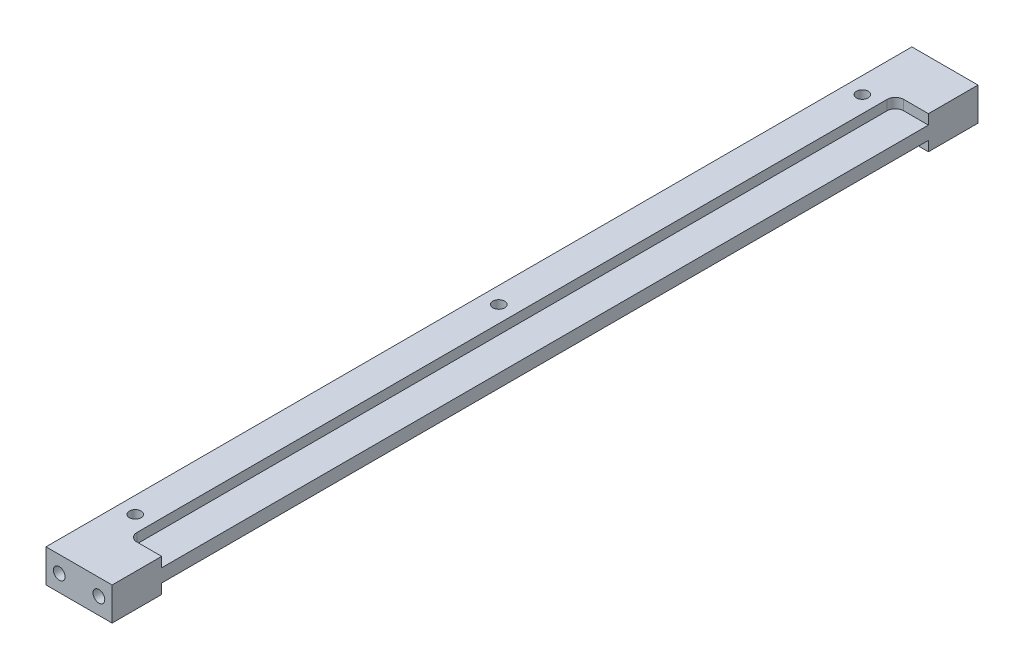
ISO-10303-21;
HEADER;
FILE_DESCRIPTION(('STEP AP214'),'2;1');
FILE_NAME('part.step','',(''),(''),'','','');
FILE_SCHEMA(('AUTOMOTIVE_DESIGN { 1 0 10303 214 1 1 1 1 }'));
ENDSEC;
DATA;
#1=APPLICATION_CONTEXT('core data for automotive mechanical design processes');
#2=APPLICATION_PROTOCOL_DEFINITION('international standard','automotive_design',2000,#1);
#3=PRODUCT_CONTEXT('',#1,'mechanical');
#4=PRODUCT('Part','Part','',(#3));
#5=PRODUCT_RELATED_PRODUCT_CATEGORY('part','',(#4));
#6=PRODUCT_DEFINITION_FORMATION('','',#4);
#7=PRODUCT_DEFINITION_CONTEXT('part definition',#1,'design');
#8=PRODUCT_DEFINITION('design','',#6,#7);
#9=PRODUCT_DEFINITION_SHAPE('','',#8);
#10=(LENGTH_UNIT() NAMED_UNIT(*) SI_UNIT(.MILLI.,.METRE.));
#11=(NAMED_UNIT(*) PLANE_ANGLE_UNIT() SI_UNIT($,.RADIAN.));
#12=(NAMED_UNIT(*) SI_UNIT($,.STERADIAN.) SOLID_ANGLE_UNIT());
#13=UNCERTAINTY_MEASURE_WITH_UNIT(LENGTH_MEASURE(1.E-05),#10,'distance_accuracy_value','');
#14=(GEOMETRIC_REPRESENTATION_CONTEXT(3) GLOBAL_UNCERTAINTY_ASSIGNED_CONTEXT((#13)) GLOBAL_UNIT_ASSIGNED_CONTEXT((#10,
#11,#12)) REPRESENTATION_CONTEXT('',''));
#15=CARTESIAN_POINT('',(0.,0.,0.));
#16=DIRECTION('',(0.,0.,1.));
#17=DIRECTION('',(1.,0.,0.));
#18=AXIS2_PLACEMENT_3D('',#15,#16,#17);
#19=CARTESIAN_POINT('',(-66.675,-63.5000000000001,166.37));
#20=DIRECTION('',(1.,0.,0.));
#21=DIRECTION('',(0.,0.,-0.999999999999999));
#22=AXIS2_PLACEMENT_3D('',#19,#20,#21);
#23=PLANE('',#22);
#24=DIRECTION('',(0.,-1.,0.));
#25=VECTOR('',#24,1.);
#26=CARTESIAN_POINT('',(-66.675,-63.5000000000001,0.));
#27=LINE('',#26,#25);
#28=CARTESIAN_POINT('',(-66.6750000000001,-57.1500000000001,0.));
#29=VERTEX_POINT('',#28);
#30=CARTESIAN_POINT('',(-66.675,-63.5000000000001,0.));
#31=VERTEX_POINT('',#30);
#32=EDGE_CURVE('E271',#29,#31,#27,.T.);
#33=ORIENTED_EDGE('',*,*,#32,.T.);
#34=DIRECTION('',(0.,0.,-0.999999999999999));
#35=VECTOR('',#34,1.);
#36=CARTESIAN_POINT('',(-66.675,-63.5000000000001,166.37));
#37=LINE('',#36,#35);
#38=CARTESIAN_POINT('',(-66.675,-63.5000000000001,166.37));
#39=VERTEX_POINT('',#38);
#40=EDGE_CURVE('E11',#39,#31,#37,.T.);
#41=ORIENTED_EDGE('',*,*,#40,.F.);
#42=DIRECTION('',(0.,-1.,0.));
#43=VECTOR('',#42,1.);
#44=CARTESIAN_POINT('',(-66.675,-63.5000000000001,166.37));
#45=LINE('',#44,#43);
#46=CARTESIAN_POINT('',(-66.6750000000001,-57.1500000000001,166.37));
#47=VERTEX_POINT('',#46);
#48=EDGE_CURVE('E282',#47,#39,#45,.T.);
#49=ORIENTED_EDGE('',*,*,#48,.F.);
#50=DIRECTION('',(0.,0.,-0.999999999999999));
#51=VECTOR('',#50,1.);
#52=CARTESIAN_POINT('',(-66.6750000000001,-57.1500000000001,166.37));
#53=LINE('',#52,#51);
#54=EDGE_CURVE('E176',#47,#29,#53,.T.);
#55=ORIENTED_EDGE('',*,*,#54,.T.);
#56=EDGE_LOOP('',(#33,#41,#49,#55));
#57=FACE_BOUND('',#56,.T.);
#58=ADVANCED_FACE('F33',(#57),#23,.F.);
#59=CARTESIAN_POINT('',(-66.675,-63.5000000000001,166.37));
#60=DIRECTION('',(0.,1.,0.));
#61=DIRECTION('',(0.,0.,0.999999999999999));
#62=AXIS2_PLACEMENT_3D('',#59,#60,#61);
#63=PLANE('',#62);
#64=CARTESIAN_POINT('',(-63.5000000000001,-63.5,152.4));
#65=DIRECTION('',(0.,1.,0.));
#66=DIRECTION('',(0.,0.,0.999999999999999));
#67=AXIS2_PLACEMENT_3D('',#64,#65,#66);
#68=CIRCLE('',#67,1.1303);
#69=CARTESIAN_POINT('',(-63.5000000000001,-63.5,153.5303));
#70=VERTEX_POINT('',#69);
#71=EDGE_CURVE('E256',#70,#70,#68,.T.);
#72=ORIENTED_EDGE('',*,*,#71,.T.);
#73=EDGE_LOOP('',(#72));
#74=FACE_BOUND('',#73,.T.);
#75=CARTESIAN_POINT('',(-63.5000000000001,-63.5,82.55));
#76=DIRECTION('',(0.,1.,0.));
#77=DIRECTION('',(0.,0.,0.999999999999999));
#78=AXIS2_PLACEMENT_3D('',#75,#76,#77);
#79=CIRCLE('',#78,1.1303);
#80=CARTESIAN_POINT('',(-63.5000000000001,-63.5,83.6803));
#81=VERTEX_POINT('',#80);
#82=EDGE_CURVE('E262',#81,#81,#79,.T.);
#83=ORIENTED_EDGE('',*,*,#82,.T.);
#84=EDGE_LOOP('',(#83));
#85=FACE_BOUND('',#84,.T.);
#86=CARTESIAN_POINT('',(-63.5000000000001,-63.5,12.7));
#87=DIRECTION('',(0.,1.,0.));
#88=DIRECTION('',(0.,0.,0.999999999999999));
#89=AXIS2_PLACEMENT_3D('',#86,#87,#88);
#90=CIRCLE('',#89,1.1303);
#91=CARTESIAN_POINT('',(-63.5000000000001,-63.5,13.8303));
#92=VERTEX_POINT('',#91);
#93=EDGE_CURVE('E268',#92,#92,#90,.T.);
#94=ORIENTED_EDGE('',*,*,#93,.T.);
#95=EDGE_LOOP('',(#94));
#96=FACE_BOUND('',#95,.T.);
#97=CARTESIAN_POINT('',(-58.7375000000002,-63.5000000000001,155.2575));
#98=DIRECTION('',(0.,-1.,0.));
#99=DIRECTION('',(0.,0.,0.999999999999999));
#100=AXIS2_PLACEMENT_3D('',#97,#98,#99);
#101=CIRCLE('',#100,1.58750000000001);
#102=CARTESIAN_POINT('',(-58.7375000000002,-63.5000000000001,156.845));
#103=VERTEX_POINT('',#102);
#104=CARTESIAN_POINT('',(-60.3250000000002,-63.5000000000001,155.2575));
#105=VERTEX_POINT('',#104);
#106=EDGE_CURVE('E195',#103,#105,#101,.T.);
#107=ORIENTED_EDGE('',*,*,#106,.F.);
#108=DIRECTION('',(-1.,0.,0.));
#109=VECTOR('',#108,1.);
#110=CARTESIAN_POINT('',(-53.9750000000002,-63.5000000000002,156.845));
#111=LINE('',#110,#109);
#112=CARTESIAN_POINT('',(-53.9750000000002,-63.5000000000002,156.845));
#113=VERTEX_POINT('',#112);
#114=EDGE_CURVE('E192',#113,#103,#111,.T.);
#115=ORIENTED_EDGE('',*,*,#114,.F.);
#116=DIRECTION('',(0.,0.,-0.999999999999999));
#117=VECTOR('',#116,1.);
#118=CARTESIAN_POINT('',(-53.9750000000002,-63.5000000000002,166.37));
#119=LINE('',#118,#117);
#120=CARTESIAN_POINT('',(-53.9750000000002,-63.5000000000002,166.37));
#121=VERTEX_POINT('',#120);
#122=EDGE_CURVE('E40',#121,#113,#119,.T.);
#123=ORIENTED_EDGE('',*,*,#122,.F.);
#124=DIRECTION('',(1.,0.,0.));
#125=VECTOR('',#124,1.);
#126=CARTESIAN_POINT('',(-66.675,-63.5000000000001,166.37));
#127=LINE('',#126,#125);
#128=EDGE_CURVE('E189',#39,#121,#127,.T.);
#129=ORIENTED_EDGE('',*,*,#128,.F.);
#130=ORIENTED_EDGE('',*,*,#40,.T.);
#131=DIRECTION('',(1.,0.,0.));
#132=VECTOR('',#131,1.);
#133=CARTESIAN_POINT('',(-66.675,-63.5000000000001,0.));
#134=LINE('',#133,#132);
#135=CARTESIAN_POINT('',(-53.9750000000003,-63.5000000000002,1.66533453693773E-13));
#136=VERTEX_POINT('',#135);
#137=EDGE_CURVE('E274',#31,#136,#134,.T.);
#138=ORIENTED_EDGE('',*,*,#137,.T.);
#139=CARTESIAN_POINT('',(-53.9750000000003,-63.5000000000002,9.52500000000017));
#140=VERTEX_POINT('',#139);
#141=EDGE_CURVE('E173',#140,#136,#119,.T.);
#142=ORIENTED_EDGE('',*,*,#141,.F.);
#143=DIRECTION('',(1.,0.,0.));
#144=VECTOR('',#143,1.);
#145=CARTESIAN_POINT('',(-53.9750000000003,-63.5000000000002,9.52500000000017));
#146=LINE('',#145,#144);
#147=CARTESIAN_POINT('',(-58.7375000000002,-63.5000000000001,9.52499999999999));
#148=VERTEX_POINT('',#147);
#149=EDGE_CURVE('E198',#148,#140,#146,.T.);
#150=ORIENTED_EDGE('',*,*,#149,.F.);
#151=CARTESIAN_POINT('',(-58.7375000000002,-63.5000000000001,11.1125));
#152=DIRECTION('',(0.,-1.,0.));
#153=DIRECTION('',(0.,0.,0.999999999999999));
#154=AXIS2_PLACEMENT_3D('',#151,#152,#153);
#155=CIRCLE('',#154,1.5875);
#156=CARTESIAN_POINT('',(-60.3250000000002,-63.5000000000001,11.1125));
#157=VERTEX_POINT('',#156);
#158=EDGE_CURVE('E203',#157,#148,#155,.T.);
#159=ORIENTED_EDGE('',*,*,#158,.F.);
#160=DIRECTION('',(0.,0.,-0.999999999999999));
#161=VECTOR('',#160,1.);
#162=CARTESIAN_POINT('',(-60.3250000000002,-63.5000000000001,11.1125));
#163=LINE('',#162,#161);
#164=EDGE_CURVE('E306',#105,#157,#163,.T.);
#165=ORIENTED_EDGE('',*,*,#164,.F.);
#166=EDGE_LOOP('',(#107,#115,#123,#129,#130,#138,#142,#150,#159,#165));
#167=FACE_BOUND('',#166,.T.);
#168=ADVANCED_FACE('F188',(#74,#85,#96,#167),#63,.F.);
#169=CARTESIAN_POINT('',(-53.9750000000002,-63.5000000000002,166.37));
#170=DIRECTION('',(-1.,0.,0.));
#171=DIRECTION('',(0.,0.,0.999999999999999));
#172=AXIS2_PLACEMENT_3D('',#169,#170,#171);
#173=PLANE('',#172);
#174=DIRECTION('',(0.,0.,-0.999999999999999));
#175=VECTOR('',#174,1.);
#176=CARTESIAN_POINT('',(-53.9750000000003,-59.0550000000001,156.845));
#177=LINE('',#176,#175);
#178=CARTESIAN_POINT('',(-53.9750000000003,-59.0550000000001,156.845));
#179=VERTEX_POINT('',#178);
#180=CARTESIAN_POINT('',(-53.9750000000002,-59.0550000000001,9.52500000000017));
#181=VERTEX_POINT('',#180);
#182=EDGE_CURVE('E167',#179,#181,#177,.T.);
#183=ORIENTED_EDGE('',*,*,#182,.F.);
#184=DIRECTION('',(0.,1.,0.));
#185=VECTOR('',#184,1.);
#186=CARTESIAN_POINT('',(-53.9750000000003,-59.0550000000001,156.845));
#187=LINE('',#186,#185);
#188=CARTESIAN_POINT('',(-53.9750000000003,-57.1500000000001,156.845));
#189=VERTEX_POINT('',#188);
#190=EDGE_CURVE('E150',#179,#189,#187,.T.);
#191=ORIENTED_EDGE('',*,*,#190,.T.);
#192=DIRECTION('',(0.,0.,-0.999999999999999));
#193=VECTOR('',#192,1.);
#194=CARTESIAN_POINT('',(-53.9750000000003,-57.1500000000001,166.37));
#195=LINE('',#194,#193);
#196=CARTESIAN_POINT('',(-53.9750000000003,-57.1500000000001,166.37));
#197=VERTEX_POINT('',#196);
#198=EDGE_CURVE('E164',#197,#189,#195,.T.);
#199=ORIENTED_EDGE('',*,*,#198,.F.);
#200=DIRECTION('',(0.,1.,0.));
#201=VECTOR('',#200,1.);
#202=CARTESIAN_POINT('',(-53.9750000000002,-63.5000000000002,166.37));
#203=LINE('',#202,#201);
#204=EDGE_CURVE('E184',#121,#197,#203,.T.);
#205=ORIENTED_EDGE('',*,*,#204,.F.);
#206=ORIENTED_EDGE('',*,*,#122,.T.);
#207=DIRECTION('',(0.,-1.,0.));
#208=VECTOR('',#207,1.);
#209=CARTESIAN_POINT('',(-53.9750000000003,-61.5950000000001,156.845));
#210=LINE('',#209,#208);
#211=CARTESIAN_POINT('',(-53.9750000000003,-61.5950000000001,156.845));
#212=VERTEX_POINT('',#211);
#213=EDGE_CURVE('E183',#212,#113,#210,.T.);
#214=ORIENTED_EDGE('',*,*,#213,.F.);
#215=DIRECTION('',(0.,0.,0.999999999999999));
#216=VECTOR('',#215,1.);
#217=CARTESIAN_POINT('',(-53.9750000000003,-61.5950000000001,156.845));
#218=LINE('',#217,#216);
#219=CARTESIAN_POINT('',(-53.9750000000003,-61.5950000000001,9.52500000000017));
#220=VERTEX_POINT('',#219);
#221=EDGE_CURVE('E212',#220,#212,#218,.T.);
#222=ORIENTED_EDGE('',*,*,#221,.F.);
#223=DIRECTION('',(0.,-1.,0.));
#224=VECTOR('',#223,1.);
#225=CARTESIAN_POINT('',(-53.9750000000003,-61.5950000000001,9.52500000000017));
#226=LINE('',#225,#224);
#227=EDGE_CURVE('E222',#220,#140,#226,.T.);
#228=ORIENTED_EDGE('',*,*,#227,.T.);
#229=ORIENTED_EDGE('',*,*,#141,.T.);
#230=DIRECTION('',(0.,1.,0.));
#231=VECTOR('',#230,1.);
#232=CARTESIAN_POINT('',(-53.9750000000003,-63.5000000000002,1.66533453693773E-13));
#233=LINE('',#232,#231);
#234=CARTESIAN_POINT('',(-53.9750000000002,-57.1500000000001,1.66533453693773E-13));
#235=VERTEX_POINT('',#234);
#236=EDGE_CURVE('E277',#136,#235,#233,.T.);
#237=ORIENTED_EDGE('',*,*,#236,.T.);
#238=CARTESIAN_POINT('',(-53.9750000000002,-57.1500000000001,9.52500000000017));
#239=VERTEX_POINT('',#238);
#240=EDGE_CURVE('E174',#239,#235,#195,.T.);
#241=ORIENTED_EDGE('',*,*,#240,.F.);
#242=DIRECTION('',(0.,1.,0.));
#243=VECTOR('',#242,1.);
#244=CARTESIAN_POINT('',(-53.9750000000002,-59.0550000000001,9.52500000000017));
#245=LINE('',#244,#243);
#246=EDGE_CURVE('E47',#181,#239,#245,.T.);
#247=ORIENTED_EDGE('',*,*,#246,.F.);
#248=EDGE_LOOP('',(#183,#191,#199,#205,#206,#214,#222,#228,#229,#237,#241,#247));
#249=FACE_BOUND('',#248,.T.);
#250=ADVANCED_FACE('F162',(#249),#173,.F.);
#251=CARTESIAN_POINT('',(-66.6750000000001,-57.1500000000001,166.37));
#252=DIRECTION('',(0.,-1.,0.));
#253=DIRECTION('',(0.,0.,-0.999999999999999));
#254=AXIS2_PLACEMENT_3D('',#251,#252,#253);
#255=PLANE('',#254);
#256=CARTESIAN_POINT('',(-63.5000000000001,-57.15,152.4));
#257=DIRECTION('',(0.,1.,0.));
#258=DIRECTION('',(0.,0.,0.999999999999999));
#259=AXIS2_PLACEMENT_3D('',#256,#257,#258);
#260=CIRCLE('',#259,1.1303);
#261=CARTESIAN_POINT('',(-63.5000000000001,-57.15,153.5303));
#262=VERTEX_POINT('',#261);
#263=EDGE_CURVE('E253',#262,#262,#260,.T.);
#264=ORIENTED_EDGE('',*,*,#263,.F.);
#265=EDGE_LOOP('',(#264));
#266=FACE_BOUND('',#265,.T.);
#267=CARTESIAN_POINT('',(-63.5000000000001,-57.15,82.55));
#268=DIRECTION('',(0.,1.,0.));
#269=DIRECTION('',(0.,0.,0.999999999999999));
#270=AXIS2_PLACEMENT_3D('',#267,#268,#269);
#271=CIRCLE('',#270,1.1303);
#272=CARTESIAN_POINT('',(-63.5000000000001,-57.15,83.6803));
#273=VERTEX_POINT('',#272);
#274=EDGE_CURVE('E259',#273,#273,#271,.T.);
#275=ORIENTED_EDGE('',*,*,#274,.F.);
#276=EDGE_LOOP('',(#275));
#277=FACE_BOUND('',#276,.T.);
#278=CARTESIAN_POINT('',(-63.5000000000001,-57.15,12.7));
#279=DIRECTION('',(0.,1.,0.));
#280=DIRECTION('',(0.,0.,0.999999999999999));
#281=AXIS2_PLACEMENT_3D('',#278,#279,#280);
#282=CIRCLE('',#281,1.1303);
#283=CARTESIAN_POINT('',(-63.5000000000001,-57.15,13.8303));
#284=VERTEX_POINT('',#283);
#285=EDGE_CURVE('E265',#284,#284,#282,.T.);
#286=ORIENTED_EDGE('',*,*,#285,.F.);
#287=EDGE_LOOP('',(#286));
#288=FACE_BOUND('',#287,.T.);
#289=ORIENTED_EDGE('',*,*,#198,.T.);
#290=DIRECTION('',(1.,0.,0.));
#291=VECTOR('',#290,1.);
#292=CARTESIAN_POINT('',(-53.9750000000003,-57.1500000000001,156.845));
#293=LINE('',#292,#291);
#294=CARTESIAN_POINT('',(-58.7375000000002,-57.1500000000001,156.845));
#295=VERTEX_POINT('',#294);
#296=EDGE_CURVE('E146',#295,#189,#293,.T.);
#297=ORIENTED_EDGE('',*,*,#296,.F.);
#298=CARTESIAN_POINT('',(-58.7375000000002,-57.1500000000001,155.2575));
#299=DIRECTION('',(0.,1.,0.));
#300=DIRECTION('',(0.,0.,0.999999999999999));
#301=AXIS2_PLACEMENT_3D('',#298,#299,#300);
#302=CIRCLE('',#301,1.58750000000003);
#303=CARTESIAN_POINT('',(-60.3250000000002,-57.1500000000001,155.2575));
#304=VERTEX_POINT('',#303);
#305=EDGE_CURVE('E332',#304,#295,#302,.T.);
#306=ORIENTED_EDGE('',*,*,#305,.F.);
#307=DIRECTION('',(0.,0.,0.999999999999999));
#308=VECTOR('',#307,1.);
#309=CARTESIAN_POINT('',(-60.3250000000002,-57.1500000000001,155.2575));
#310=LINE('',#309,#308);
#311=CARTESIAN_POINT('',(-60.3250000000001,-57.1500000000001,11.1125));
#312=VERTEX_POINT('',#311);
#313=EDGE_CURVE('E334',#312,#304,#310,.T.);
#314=ORIENTED_EDGE('',*,*,#313,.F.);
#315=CARTESIAN_POINT('',(-58.7375000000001,-57.1500000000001,11.1125));
#316=DIRECTION('',(0.,1.,0.));
#317=DIRECTION('',(0.,0.,0.999999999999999));
#318=AXIS2_PLACEMENT_3D('',#315,#316,#317);
#319=CIRCLE('',#318,1.5875);
#320=CARTESIAN_POINT('',(-58.7375000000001,-57.1500000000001,9.52500000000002));
#321=VERTEX_POINT('',#320);
#322=EDGE_CURVE('E337',#321,#312,#319,.T.);
#323=ORIENTED_EDGE('',*,*,#322,.F.);
#324=DIRECTION('',(-1.,0.,0.));
#325=VECTOR('',#324,1.);
#326=CARTESIAN_POINT('',(-58.7375000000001,-57.1500000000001,9.52500000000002));
#327=LINE('',#326,#325);
#328=EDGE_CURVE('E157',#239,#321,#327,.T.);
#329=ORIENTED_EDGE('',*,*,#328,.F.);
#330=ORIENTED_EDGE('',*,*,#240,.T.);
#331=DIRECTION('',(-1.,0.,0.));
#332=VECTOR('',#331,1.);
#333=CARTESIAN_POINT('',(-66.6750000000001,-57.1500000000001,0.));
#334=LINE('',#333,#332);
#335=EDGE_CURVE('E280',#235,#29,#334,.T.);
#336=ORIENTED_EDGE('',*,*,#335,.T.);
#337=ORIENTED_EDGE('',*,*,#54,.F.);
#338=DIRECTION('',(-1.,0.,0.));
#339=VECTOR('',#338,1.);
#340=CARTESIAN_POINT('',(-66.6750000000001,-57.1500000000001,166.37));
#341=LINE('',#340,#339);
#342=EDGE_CURVE('E172',#197,#47,#341,.T.);
#343=ORIENTED_EDGE('',*,*,#342,.F.);
#344=EDGE_LOOP('',(#289,#297,#306,#314,#323,#329,#330,#336,#337,#343));
#345=FACE_BOUND('',#344,.T.);
#346=ADVANCED_FACE('F170',(#266,#277,#288,#345),#255,.F.);
#347=CARTESIAN_POINT('',(-66.6750000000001,-57.1500000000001,166.37));
#348=DIRECTION('',(0.,0.,-0.999999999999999));
#349=DIRECTION('',(-1.,0.,0.));
#350=AXIS2_PLACEMENT_3D('',#347,#348,#349);
#351=PLANE('',#350);
#352=CARTESIAN_POINT('',(-56.5150000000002,-60.3033219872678,166.37));
#353=DIRECTION('',(0.,0.,0.999999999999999));
#354=DIRECTION('',(1.,0.,0.));
#355=AXIS2_PLACEMENT_3D('',#352,#353,#354);
#356=CIRCLE('',#355,1.1303);
#357=CARTESIAN_POINT('',(-55.3847000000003,-60.3033219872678,166.37));
#358=VERTEX_POINT('',#357);
#359=EDGE_CURVE('E241',#358,#358,#356,.T.);
#360=ORIENTED_EDGE('',*,*,#359,.F.);
#361=EDGE_LOOP('',(#360));
#362=FACE_BOUND('',#361,.T.);
#363=CARTESIAN_POINT('',(-64.135,-60.3033219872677,166.37));
#364=DIRECTION('',(0.,0.,0.999999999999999));
#365=DIRECTION('',(1.,0.,0.));
#366=AXIS2_PLACEMENT_3D('',#363,#364,#365);
#367=CIRCLE('',#366,1.1303);
#368=CARTESIAN_POINT('',(-63.0047,-60.3033219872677,166.37));
#369=VERTEX_POINT('',#368);
#370=EDGE_CURVE('E247',#369,#369,#367,.T.);
#371=ORIENTED_EDGE('',*,*,#370,.F.);
#372=EDGE_LOOP('',(#371));
#373=FACE_BOUND('',#372,.T.);
#374=ORIENTED_EDGE('',*,*,#48,.T.);
#375=ORIENTED_EDGE('',*,*,#128,.T.);
#376=ORIENTED_EDGE('',*,*,#204,.T.);
#377=ORIENTED_EDGE('',*,*,#342,.T.);
#378=EDGE_LOOP('',(#374,#375,#376,#377));
#379=FACE_BOUND('',#378,.T.);
#380=ADVANCED_FACE('F375',(#362,#373,#379),#351,.F.);
#381=CARTESIAN_POINT('',(-66.6750000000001,-57.1500000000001,0.));
#382=DIRECTION('',(0.,0.,-0.999999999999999));
#383=DIRECTION('',(-1.,0.,0.));
#384=AXIS2_PLACEMENT_3D('',#381,#382,#383);
#385=PLANE('',#384);
#386=CARTESIAN_POINT('',(-56.515,-60.3033219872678,1.66533453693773E-13));
#387=DIRECTION('',(0.,0.,-0.999999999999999));
#388=DIRECTION('',(-1.,0.,0.));
#389=AXIS2_PLACEMENT_3D('',#386,#387,#388);
#390=CIRCLE('',#389,1.1303);
#391=CARTESIAN_POINT('',(-57.6453,-60.3033219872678,1.66533453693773E-13));
#392=VERTEX_POINT('',#391);
#393=EDGE_CURVE('E220',#392,#392,#390,.T.);
#394=ORIENTED_EDGE('',*,*,#393,.F.);
#395=EDGE_LOOP('',(#394));
#396=FACE_BOUND('',#395,.T.);
#397=CARTESIAN_POINT('',(-64.1349999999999,-60.3033219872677,0.));
#398=DIRECTION('',(0.,0.,-0.999999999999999));
#399=DIRECTION('',(-1.,0.,0.));
#400=AXIS2_PLACEMENT_3D('',#397,#398,#399);
#401=CIRCLE('',#400,1.1303);
#402=CARTESIAN_POINT('',(-65.2653000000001,-60.3033219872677,0.));
#403=VERTEX_POINT('',#402);
#404=EDGE_CURVE('E235',#403,#403,#401,.T.);
#405=ORIENTED_EDGE('',*,*,#404,.F.);
#406=EDGE_LOOP('',(#405));
#407=FACE_BOUND('',#406,.T.);
#408=ORIENTED_EDGE('',*,*,#32,.F.);
#409=ORIENTED_EDGE('',*,*,#335,.F.);
#410=ORIENTED_EDGE('',*,*,#236,.F.);
#411=ORIENTED_EDGE('',*,*,#137,.F.);
#412=EDGE_LOOP('',(#408,#409,#410,#411));
#413=FACE_BOUND('',#412,.T.);
#414=ADVANCED_FACE('F293',(#396,#407,#413),#385,.T.);
#415=CARTESIAN_POINT('',(-63.5000000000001,-63.5,12.7));
#416=DIRECTION('',(0.,1.,0.));
#417=DIRECTION('',(0.,0.,0.999999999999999));
#418=AXIS2_PLACEMENT_3D('',#415,#416,#417);
#419=CYLINDRICAL_SURFACE('',#418,1.1303);
#420=ORIENTED_EDGE('',*,*,#93,.F.);
#421=EDGE_LOOP('',(#420));
#422=FACE_BOUND('',#421,.T.);
#423=ORIENTED_EDGE('',*,*,#285,.T.);
#424=EDGE_LOOP('',(#423));
#425=FACE_BOUND('',#424,.T.);
#426=ADVANCED_FACE('F382',(#422,#425),#419,.F.);
#427=CARTESIAN_POINT('',(-63.5000000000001,-63.5,82.55));
#428=DIRECTION('',(0.,1.,0.));
#429=DIRECTION('',(0.,0.,0.999999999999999));
#430=AXIS2_PLACEMENT_3D('',#427,#428,#429);
#431=CYLINDRICAL_SURFACE('',#430,1.1303);
#432=ORIENTED_EDGE('',*,*,#82,.F.);
#433=EDGE_LOOP('',(#432));
#434=FACE_BOUND('',#433,.T.);
#435=ORIENTED_EDGE('',*,*,#274,.T.);
#436=EDGE_LOOP('',(#435));
#437=FACE_BOUND('',#436,.T.);
#438=ADVANCED_FACE('F386',(#434,#437),#431,.F.);
#439=CARTESIAN_POINT('',(-63.5000000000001,-63.5,152.4));
#440=DIRECTION('',(0.,1.,0.));
#441=DIRECTION('',(0.,0.,0.999999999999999));
#442=AXIS2_PLACEMENT_3D('',#439,#440,#441);
#443=CYLINDRICAL_SURFACE('',#442,1.1303);
#444=ORIENTED_EDGE('',*,*,#71,.F.);
#445=EDGE_LOOP('',(#444));
#446=FACE_BOUND('',#445,.T.);
#447=ORIENTED_EDGE('',*,*,#263,.T.);
#448=EDGE_LOOP('',(#447));
#449=FACE_BOUND('',#448,.T.);
#450=ADVANCED_FACE('F390',(#446,#449),#443,.F.);
#451=CARTESIAN_POINT('',(-64.135,-60.3033219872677,156.845));
#452=DIRECTION('',(0.,0.,0.999999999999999));
#453=DIRECTION('',(1.,0.,0.));
#454=AXIS2_PLACEMENT_3D('',#451,#452,#453);
#455=CYLINDRICAL_SURFACE('',#454,1.1303);
#456=CARTESIAN_POINT('',(-64.135,-60.3033219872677,156.845));
#457=DIRECTION('',(0.,0.,0.999999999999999));
#458=DIRECTION('',(1.,0.,0.));
#459=AXIS2_PLACEMENT_3D('',#456,#457,#458);
#460=CIRCLE('',#459,1.1303);
#461=CARTESIAN_POINT('',(-63.0047,-60.3033219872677,156.845));
#462=VERTEX_POINT('',#461);
#463=EDGE_CURVE('E250',#462,#462,#460,.T.);
#464=CARTESIAN_POINT('',(-63.0047,-60.3033219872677,156.845));
#465=CARTESIAN_POINT('',(-63.0047,-60.3033219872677,156.94421875));
#466=CARTESIAN_POINT('',(-63.0047,-60.3033219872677,157.0434375));
#467=CARTESIAN_POINT('',(-63.0047,-60.3033219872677,157.241875));
#468=CARTESIAN_POINT('',(-63.0047,-60.3033219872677,157.34109375));
#469=CARTESIAN_POINT('',(-63.0047,-60.3033219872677,157.53953125));
#470=CARTESIAN_POINT('',(-63.0047,-60.3033219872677,157.63875));
#471=CARTESIAN_POINT('',(-63.0047,-60.3033219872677,157.8371875));
#472=CARTESIAN_POINT('',(-63.0047,-60.3033219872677,157.93640625));
#473=CARTESIAN_POINT('',(-63.0047,-60.3033219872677,158.13484375));
#474=CARTESIAN_POINT('',(-63.0047,-60.3033219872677,158.2340625));
#475=CARTESIAN_POINT('',(-63.0047,-60.3033219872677,158.4325));
#476=CARTESIAN_POINT('',(-63.0047,-60.3033219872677,158.53171875));
#477=CARTESIAN_POINT('',(-63.0047,-60.3033219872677,158.73015625));
#478=CARTESIAN_POINT('',(-63.0047,-60.3033219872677,158.829375));
#479=CARTESIAN_POINT('',(-63.0047,-60.3033219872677,159.0278125));
#480=CARTESIAN_POINT('',(-63.0047,-60.3033219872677,159.12703125));
#481=CARTESIAN_POINT('',(-63.0047,-60.3033219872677,159.32546875));
#482=CARTESIAN_POINT('',(-63.0047,-60.3033219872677,159.4246875));
#483=CARTESIAN_POINT('',(-63.0047,-60.3033219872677,159.623125));
#484=CARTESIAN_POINT('',(-63.0047,-60.3033219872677,159.72234375));
#485=CARTESIAN_POINT('',(-63.0047,-60.3033219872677,159.92078125));
#486=CARTESIAN_POINT('',(-63.0047,-60.3033219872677,160.02));
#487=CARTESIAN_POINT('',(-63.0047,-60.3033219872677,160.2184375));
#488=CARTESIAN_POINT('',(-63.0047,-60.3033219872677,160.31765625));
#489=CARTESIAN_POINT('',(-63.0047,-60.3033219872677,160.51609375));
#490=CARTESIAN_POINT('',(-63.0047,-60.3033219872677,160.6153125));
#491=CARTESIAN_POINT('',(-63.0047,-60.3033219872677,160.81375));
#492=CARTESIAN_POINT('',(-63.0047,-60.3033219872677,160.91296875));
#493=CARTESIAN_POINT('',(-63.0047,-60.3033219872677,161.11140625));
#494=CARTESIAN_POINT('',(-63.0047,-60.3033219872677,161.210625));
#495=CARTESIAN_POINT('',(-63.0047,-60.3033219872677,161.4090625));
#496=CARTESIAN_POINT('',(-63.0047,-60.3033219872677,161.50828125));
#497=CARTESIAN_POINT('',(-63.0047,-60.3033219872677,161.70671875));
#498=CARTESIAN_POINT('',(-63.0047,-60.3033219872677,161.8059375));
#499=CARTESIAN_POINT('',(-63.0047,-60.3033219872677,162.004375));
#500=CARTESIAN_POINT('',(-63.0047,-60.3033219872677,162.10359375));
#501=CARTESIAN_POINT('',(-63.0047,-60.3033219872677,162.30203125));
#502=CARTESIAN_POINT('',(-63.0047,-60.3033219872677,162.40125));
#503=CARTESIAN_POINT('',(-63.0047,-60.3033219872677,162.5996875));
#504=CARTESIAN_POINT('',(-63.0047,-60.3033219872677,162.69890625));
#505=CARTESIAN_POINT('',(-63.0047,-60.3033219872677,162.89734375));
#506=CARTESIAN_POINT('',(-63.0047,-60.3033219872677,162.9965625));
#507=CARTESIAN_POINT('',(-63.0047,-60.3033219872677,163.195));
#508=CARTESIAN_POINT('',(-63.0047,-60.3033219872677,163.29421875));
#509=CARTESIAN_POINT('',(-63.0047,-60.3033219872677,163.49265625));
#510=CARTESIAN_POINT('',(-63.0047,-60.3033219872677,163.591875));
#511=CARTESIAN_POINT('',(-63.0047,-60.3033219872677,163.7903125));
#512=CARTESIAN_POINT('',(-63.0047,-60.3033219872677,163.88953125));
#513=CARTESIAN_POINT('',(-63.0047,-60.3033219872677,164.08796875));
#514=CARTESIAN_POINT('',(-63.0047,-60.3033219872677,164.1871875));
#515=CARTESIAN_POINT('',(-63.0047,-60.3033219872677,164.385625));
#516=CARTESIAN_POINT('',(-63.0047,-60.3033219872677,164.48484375));
#517=CARTESIAN_POINT('',(-63.0047,-60.3033219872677,164.68328125));
#518=CARTESIAN_POINT('',(-63.0047,-60.3033219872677,164.7825));
#519=CARTESIAN_POINT('',(-63.0047,-60.3033219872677,164.9809375));
#520=CARTESIAN_POINT('',(-63.0047,-60.3033219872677,165.08015625));
#521=CARTESIAN_POINT('',(-63.0047,-60.3033219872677,165.27859375));
#522=CARTESIAN_POINT('',(-63.0047,-60.3033219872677,165.3778125));
#523=CARTESIAN_POINT('',(-63.0047,-60.3033219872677,165.57625));
#524=CARTESIAN_POINT('',(-63.0047,-60.3033219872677,165.67546875));
#525=CARTESIAN_POINT('',(-63.0047,-60.3033219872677,165.87390625));
#526=CARTESIAN_POINT('',(-63.0047,-60.3033219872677,165.973125));
#527=CARTESIAN_POINT('',(-63.0047,-60.3033219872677,166.1715625));
#528=CARTESIAN_POINT('',(-63.0047,-60.3033219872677,166.27078125));
#529=CARTESIAN_POINT('',(-63.0047,-60.3033219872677,166.37));
#530=B_SPLINE_CURVE_WITH_KNOTS('',3,(#464,#465,#466,#467,#468,#469,#470,#471,#472,#473,#474,
#475,#476,#477,#478,#479,#480,#481,#482,#483,#484,#485,#486,#487,#488,#489,#490,#491,#492,#493,
#494,#495,#496,#497,#498,#499,#500,#501,#502,#503,#504,#505,#506,#507,#508,#509,#510,#511,#512,
#513,#514,#515,#516,#517,#518,#519,#520,#521,#522,#523,#524,#525,#526,#527,#528,#529),
.UNSPECIFIED.,.F.,.F.,(4,2,2,2,2,2,2,2,2,2,2,2,2,2,2,2,2,2,2,2,2,2,2,2,2,2,2,2,2,2,2,2,4),(0.,
0.29765625,0.5953125,0.892968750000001,1.190625,1.48828125,1.7859375,2.08359375,2.38125,
2.67890625,2.9765625,3.27421875,3.571875,3.86953125,4.1671875,4.46484375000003,4.7625,
5.06015625,5.3578125,5.65546875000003,5.953125,6.25078125,6.5484375,6.84609375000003,7.14375,
7.44140625,7.7390625,8.03671875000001,8.334375,8.63203125,8.92968750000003,9.22734375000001,
9.52500000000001),.UNSPECIFIED.);
#531=EDGE_CURVE('BSEAM394',#462,#369,#530,.T.);
#532=ORIENTED_EDGE('',*,*,#463,.F.);
#533=ORIENTED_EDGE('',*,*,#370,.T.);
#534=ORIENTED_EDGE('',*,*,#531,.T.);
#535=ORIENTED_EDGE('',*,*,#531,.F.);
#536=EDGE_LOOP('',(#532,#534,#533,#535));
#537=FACE_BOUND('',#536,.T.);
#538=ADVANCED_FACE('F394',(#537),#455,.F.);
#539=CARTESIAN_POINT('',(-64.135,-60.3033219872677,156.845));
#540=DIRECTION('',(0.,0.,0.999999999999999));
#541=DIRECTION('',(1.,0.,0.));
#542=AXIS2_PLACEMENT_3D('',#539,#540,#541);
#543=PLANE('',#542);
#544=ORIENTED_EDGE('',*,*,#463,.T.);
#545=EDGE_LOOP('',(#544));
#546=FACE_BOUND('',#545,.T.);
#547=ADVANCED_FACE('F398',(#546),#543,.T.);
#548=CARTESIAN_POINT('',(-56.5150000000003,-60.3033219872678,156.845));
#549=DIRECTION('',(0.,0.,0.999999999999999));
#550=DIRECTION('',(1.,0.,0.));
#551=AXIS2_PLACEMENT_3D('',#548,#549,#550);
#552=CYLINDRICAL_SURFACE('',#551,1.1303);
#553=CARTESIAN_POINT('',(-56.5150000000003,-60.3033219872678,156.845));
#554=DIRECTION('',(0.,0.,0.999999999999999));
#555=DIRECTION('',(1.,0.,0.));
#556=AXIS2_PLACEMENT_3D('',#553,#554,#555);
#557=CIRCLE('',#556,1.1303);
#558=CARTESIAN_POINT('',(-55.3847000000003,-60.3033219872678,156.845));
#559=VERTEX_POINT('',#558);
#560=EDGE_CURVE('E244',#559,#559,#557,.T.);
#561=CARTESIAN_POINT('',(-55.3847000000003,-60.3033219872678,156.845));
#562=CARTESIAN_POINT('',(-55.3847000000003,-60.3033219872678,156.94421875));
#563=CARTESIAN_POINT('',(-55.3847000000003,-60.3033219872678,157.0434375));
#564=CARTESIAN_POINT('',(-55.3847000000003,-60.3033219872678,157.241875));
#565=CARTESIAN_POINT('',(-55.3847000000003,-60.3033219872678,157.34109375));
#566=CARTESIAN_POINT('',(-55.3847000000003,-60.3033219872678,157.53953125));
#567=CARTESIAN_POINT('',(-55.3847000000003,-60.3033219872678,157.63875));
#568=CARTESIAN_POINT('',(-55.3847000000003,-60.3033219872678,157.8371875));
#569=CARTESIAN_POINT('',(-55.3847000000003,-60.3033219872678,157.93640625));
#570=CARTESIAN_POINT('',(-55.3847000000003,-60.3033219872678,158.13484375));
#571=CARTESIAN_POINT('',(-55.3847000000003,-60.3033219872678,158.2340625));
#572=CARTESIAN_POINT('',(-55.3847000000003,-60.3033219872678,158.4325));
#573=CARTESIAN_POINT('',(-55.3847000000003,-60.3033219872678,158.53171875));
#574=CARTESIAN_POINT('',(-55.3847000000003,-60.3033219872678,158.73015625));
#575=CARTESIAN_POINT('',(-55.3847000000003,-60.3033219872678,158.829375));
#576=CARTESIAN_POINT('',(-55.3847000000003,-60.3033219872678,159.0278125));
#577=CARTESIAN_POINT('',(-55.3847000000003,-60.3033219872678,159.12703125));
#578=CARTESIAN_POINT('',(-55.3847000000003,-60.3033219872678,159.32546875));
#579=CARTESIAN_POINT('',(-55.3847000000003,-60.3033219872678,159.4246875));
#580=CARTESIAN_POINT('',(-55.3847000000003,-60.3033219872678,159.623125));
#581=CARTESIAN_POINT('',(-55.3847000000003,-60.3033219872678,159.72234375));
#582=CARTESIAN_POINT('',(-55.3847000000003,-60.3033219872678,159.92078125));
#583=CARTESIAN_POINT('',(-55.3847000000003,-60.3033219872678,160.02));
#584=CARTESIAN_POINT('',(-55.3847000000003,-60.3033219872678,160.2184375));
#585=CARTESIAN_POINT('',(-55.3847000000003,-60.3033219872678,160.31765625));
#586=CARTESIAN_POINT('',(-55.3847000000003,-60.3033219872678,160.51609375));
#587=CARTESIAN_POINT('',(-55.3847000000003,-60.3033219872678,160.6153125));
#588=CARTESIAN_POINT('',(-55.3847000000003,-60.3033219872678,160.81375));
#589=CARTESIAN_POINT('',(-55.3847000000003,-60.3033219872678,160.91296875));
#590=CARTESIAN_POINT('',(-55.3847000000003,-60.3033219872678,161.11140625));
#591=CARTESIAN_POINT('',(-55.3847000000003,-60.3033219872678,161.210625));
#592=CARTESIAN_POINT('',(-55.3847000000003,-60.3033219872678,161.4090625));
#593=CARTESIAN_POINT('',(-55.3847000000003,-60.3033219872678,161.50828125));
#594=CARTESIAN_POINT('',(-55.3847000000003,-60.3033219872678,161.70671875));
#595=CARTESIAN_POINT('',(-55.3847000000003,-60.3033219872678,161.8059375));
#596=CARTESIAN_POINT('',(-55.3847000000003,-60.3033219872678,162.004375));
#597=CARTESIAN_POINT('',(-55.3847000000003,-60.3033219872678,162.10359375));
#598=CARTESIAN_POINT('',(-55.3847000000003,-60.3033219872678,162.30203125));
#599=CARTESIAN_POINT('',(-55.3847000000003,-60.3033219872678,162.40125));
#600=CARTESIAN_POINT('',(-55.3847000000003,-60.3033219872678,162.5996875));
#601=CARTESIAN_POINT('',(-55.3847000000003,-60.3033219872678,162.69890625));
#602=CARTESIAN_POINT('',(-55.3847000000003,-60.3033219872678,162.89734375));
#603=CARTESIAN_POINT('',(-55.3847000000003,-60.3033219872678,162.9965625));
#604=CARTESIAN_POINT('',(-55.3847000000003,-60.3033219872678,163.195));
#605=CARTESIAN_POINT('',(-55.3847000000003,-60.3033219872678,163.29421875));
#606=CARTESIAN_POINT('',(-55.3847000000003,-60.3033219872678,163.49265625));
#607=CARTESIAN_POINT('',(-55.3847000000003,-60.3033219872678,163.591875));
#608=CARTESIAN_POINT('',(-55.3847000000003,-60.3033219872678,163.7903125));
#609=CARTESIAN_POINT('',(-55.3847000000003,-60.3033219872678,163.88953125));
#610=CARTESIAN_POINT('',(-55.3847000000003,-60.3033219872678,164.08796875));
#611=CARTESIAN_POINT('',(-55.3847000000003,-60.3033219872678,164.1871875));
#612=CARTESIAN_POINT('',(-55.3847000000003,-60.3033219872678,164.385625));
#613=CARTESIAN_POINT('',(-55.3847000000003,-60.3033219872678,164.48484375));
#614=CARTESIAN_POINT('',(-55.3847000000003,-60.3033219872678,164.68328125));
#615=CARTESIAN_POINT('',(-55.3847000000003,-60.3033219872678,164.7825));
#616=CARTESIAN_POINT('',(-55.3847000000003,-60.3033219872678,164.9809375));
#617=CARTESIAN_POINT('',(-55.3847000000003,-60.3033219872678,165.08015625));
#618=CARTESIAN_POINT('',(-55.3847000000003,-60.3033219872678,165.27859375));
#619=CARTESIAN_POINT('',(-55.3847000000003,-60.3033219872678,165.3778125));
#620=CARTESIAN_POINT('',(-55.3847000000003,-60.3033219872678,165.57625));
#621=CARTESIAN_POINT('',(-55.3847000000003,-60.3033219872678,165.67546875));
#622=CARTESIAN_POINT('',(-55.3847000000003,-60.3033219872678,165.87390625));
#623=CARTESIAN_POINT('',(-55.3847000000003,-60.3033219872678,165.973125));
#624=CARTESIAN_POINT('',(-55.3847000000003,-60.3033219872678,166.1715625));
#625=CARTESIAN_POINT('',(-55.3847000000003,-60.3033219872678,166.27078125));
#626=CARTESIAN_POINT('',(-55.3847000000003,-60.3033219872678,166.37));
#627=B_SPLINE_CURVE_WITH_KNOTS('',3,(#561,#562,#563,#564,#565,#566,#567,#568,#569,#570,#571,
#572,#573,#574,#575,#576,#577,#578,#579,#580,#581,#582,#583,#584,#585,#586,#587,#588,#589,#590,
#591,#592,#593,#594,#595,#596,#597,#598,#599,#600,#601,#602,#603,#604,#605,#606,#607,#608,#609,
#610,#611,#612,#613,#614,#615,#616,#617,#618,#619,#620,#621,#622,#623,#624,#625,#626),
.UNSPECIFIED.,.F.,.F.,(4,2,2,2,2,2,2,2,2,2,2,2,2,2,2,2,2,2,2,2,2,2,2,2,2,2,2,2,2,2,2,2,4),(0.,
0.29765625,0.5953125,0.892968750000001,1.190625,1.48828125,1.7859375,2.08359375,2.38125,
2.67890625,2.9765625,3.27421875,3.571875,3.86953125,4.1671875,4.46484375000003,4.7625,
5.06015625,5.3578125,5.65546875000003,5.953125,6.25078125,6.5484375,6.84609375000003,7.14375,
7.44140625,7.7390625,8.03671875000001,8.334375,8.63203125,8.92968750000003,9.22734375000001,
9.52500000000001),.UNSPECIFIED.);
#628=EDGE_CURVE('BSEAM402',#559,#358,#627,.T.);
#629=ORIENTED_EDGE('',*,*,#560,.F.);
#630=ORIENTED_EDGE('',*,*,#359,.T.);
#631=ORIENTED_EDGE('',*,*,#628,.T.);
#632=ORIENTED_EDGE('',*,*,#628,.F.);
#633=EDGE_LOOP('',(#629,#631,#630,#632));
#634=FACE_BOUND('',#633,.T.);
#635=ADVANCED_FACE('F402',(#634),#552,.F.);
#636=CARTESIAN_POINT('',(-56.5150000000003,-60.3033219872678,156.845));
#637=DIRECTION('',(0.,0.,0.999999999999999));
#638=DIRECTION('',(1.,0.,0.));
#639=AXIS2_PLACEMENT_3D('',#636,#637,#638);
#640=PLANE('',#639);
#641=ORIENTED_EDGE('',*,*,#560,.T.);
#642=EDGE_LOOP('',(#641));
#643=FACE_BOUND('',#642,.T.);
#644=ADVANCED_FACE('F406',(#643),#640,.T.);
#645=CARTESIAN_POINT('',(-64.135,-60.3033219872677,9.52499999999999));
#646=DIRECTION('',(0.,0.,-0.999999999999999));
#647=DIRECTION('',(-1.,0.,0.));
#648=AXIS2_PLACEMENT_3D('',#645,#646,#647);
#649=CYLINDRICAL_SURFACE('',#648,1.1303);
#650=CARTESIAN_POINT('',(-64.135,-60.3033219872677,9.52499999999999));
#651=DIRECTION('',(0.,0.,-0.999999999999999));
#652=DIRECTION('',(-1.,0.,0.));
#653=AXIS2_PLACEMENT_3D('',#650,#651,#652);
#654=CIRCLE('',#653,1.1303);
#655=CARTESIAN_POINT('',(-65.2653000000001,-60.3033219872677,9.52499999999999));
#656=VERTEX_POINT('',#655);
#657=EDGE_CURVE('E238',#656,#656,#654,.T.);
#658=CARTESIAN_POINT('',(-65.2653000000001,-60.3033219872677,9.52499999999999));
#659=CARTESIAN_POINT('',(-65.2653000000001,-60.3033219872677,9.42578124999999));
#660=CARTESIAN_POINT('',(-65.2653000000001,-60.3033219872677,9.32656249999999));
#661=CARTESIAN_POINT('',(-65.2653000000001,-60.3033219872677,9.12812499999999));
#662=CARTESIAN_POINT('',(-65.2653000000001,-60.3033219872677,9.02890624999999));
#663=CARTESIAN_POINT('',(-65.2653000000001,-60.3033219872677,8.83046874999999));
#664=CARTESIAN_POINT('',(-65.2653000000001,-60.3033219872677,8.73124999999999));
#665=CARTESIAN_POINT('',(-65.2653000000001,-60.3033219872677,8.53281249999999));
#666=CARTESIAN_POINT('',(-65.2653000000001,-60.3033219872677,8.43359374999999));
#667=CARTESIAN_POINT('',(-65.2653000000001,-60.3033219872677,8.23515624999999));
#668=CARTESIAN_POINT('',(-65.2653000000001,-60.3033219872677,8.13593749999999));
#669=CARTESIAN_POINT('',(-65.2653000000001,-60.3033219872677,7.93749999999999));
#670=CARTESIAN_POINT('',(-65.2653000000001,-60.3033219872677,7.83828124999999));
#671=CARTESIAN_POINT('',(-65.2653000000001,-60.3033219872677,7.63984374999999));
#672=CARTESIAN_POINT('',(-65.2653000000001,-60.3033219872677,7.54062499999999));
#673=CARTESIAN_POINT('',(-65.2653000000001,-60.3033219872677,7.34218749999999));
#674=CARTESIAN_POINT('',(-65.2653000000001,-60.3033219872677,7.24296874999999));
#675=CARTESIAN_POINT('',(-65.2653000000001,-60.3033219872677,7.04453124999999));
#676=CARTESIAN_POINT('',(-65.2653000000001,-60.3033219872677,6.94531249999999));
#677=CARTESIAN_POINT('',(-65.2653000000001,-60.3033219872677,6.74687499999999));
#678=CARTESIAN_POINT('',(-65.2653000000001,-60.3033219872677,6.64765624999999));
#679=CARTESIAN_POINT('',(-65.2653000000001,-60.3033219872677,6.44921874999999));
#680=CARTESIAN_POINT('',(-65.2653000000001,-60.3033219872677,6.34999999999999));
#681=CARTESIAN_POINT('',(-65.2653000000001,-60.3033219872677,6.15156249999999));
#682=CARTESIAN_POINT('',(-65.2653000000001,-60.3033219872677,6.05234374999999));
#683=CARTESIAN_POINT('',(-65.2653000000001,-60.3033219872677,5.85390624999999));
#684=CARTESIAN_POINT('',(-65.2653000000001,-60.3033219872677,5.75468749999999));
#685=CARTESIAN_POINT('',(-65.2653000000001,-60.3033219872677,5.55625));
#686=CARTESIAN_POINT('',(-65.2653000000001,-60.3033219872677,5.45703124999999));
#687=CARTESIAN_POINT('',(-65.2653000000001,-60.3033219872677,5.25859374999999));
#688=CARTESIAN_POINT('',(-65.2653000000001,-60.3033219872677,5.159375));
#689=CARTESIAN_POINT('',(-65.2653000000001,-60.3033219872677,4.9609375));
#690=CARTESIAN_POINT('',(-65.2653000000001,-60.3033219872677,4.86171875));
#691=CARTESIAN_POINT('',(-65.2653000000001,-60.3033219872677,4.66328125));
#692=CARTESIAN_POINT('',(-65.2653000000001,-60.3033219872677,4.5640625));
#693=CARTESIAN_POINT('',(-65.2653000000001,-60.3033219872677,4.365625));
#694=CARTESIAN_POINT('',(-65.2653000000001,-60.3033219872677,4.26640625));
#695=CARTESIAN_POINT('',(-65.2653000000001,-60.3033219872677,4.06796875));
#696=CARTESIAN_POINT('',(-65.2653000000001,-60.3033219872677,3.96875));
#697=CARTESIAN_POINT('',(-65.2653000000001,-60.3033219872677,3.7703125));
#698=CARTESIAN_POINT('',(-65.2653000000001,-60.3033219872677,3.67109375));
#699=CARTESIAN_POINT('',(-65.2653000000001,-60.3033219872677,3.47265625));
#700=CARTESIAN_POINT('',(-65.2653000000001,-60.3033219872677,3.3734375));
#701=CARTESIAN_POINT('',(-65.2653000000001,-60.3033219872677,3.175));
#702=CARTESIAN_POINT('',(-65.2653000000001,-60.3033219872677,3.07578125));
#703=CARTESIAN_POINT('',(-65.2653000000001,-60.3033219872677,2.87734375));
#704=CARTESIAN_POINT('',(-65.2653000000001,-60.3033219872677,2.778125));
#705=CARTESIAN_POINT('',(-65.2653000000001,-60.3033219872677,2.5796875));
#706=CARTESIAN_POINT('',(-65.2653000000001,-60.3033219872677,2.48046875));
#707=CARTESIAN_POINT('',(-65.2653000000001,-60.3033219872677,2.28203125));
#708=CARTESIAN_POINT('',(-65.2653000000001,-60.3033219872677,2.1828125));
#709=CARTESIAN_POINT('',(-65.2653000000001,-60.3033219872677,1.984375));
#710=CARTESIAN_POINT('',(-65.2653000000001,-60.3033219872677,1.88515625));
#711=CARTESIAN_POINT('',(-65.2653000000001,-60.3033219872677,1.68671875));
#712=CARTESIAN_POINT('',(-65.2653000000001,-60.3033219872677,1.5875));
#713=CARTESIAN_POINT('',(-65.2653000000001,-60.3033219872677,1.3890625));
#714=CARTESIAN_POINT('',(-65.2653000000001,-60.3033219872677,1.28984375));
#715=CARTESIAN_POINT('',(-65.2653000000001,-60.3033219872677,1.09140625));
#716=CARTESIAN_POINT('',(-65.2653000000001,-60.3033219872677,0.992187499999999));
#717=CARTESIAN_POINT('',(-65.2653000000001,-60.3033219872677,0.793749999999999));
#718=CARTESIAN_POINT('',(-65.2653000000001,-60.3033219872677,0.694531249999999));
#719=CARTESIAN_POINT('',(-65.2653000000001,-60.3033219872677,0.496093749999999));
#720=CARTESIAN_POINT('',(-65.2653000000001,-60.3033219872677,0.396875));
#721=CARTESIAN_POINT('',(-65.2653000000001,-60.3033219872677,0.1984375));
#722=CARTESIAN_POINT('',(-65.2653000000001,-60.3033219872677,0.0992187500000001));
#723=CARTESIAN_POINT('',(-65.2653000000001,-60.3033219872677,0.));
#724=B_SPLINE_CURVE_WITH_KNOTS('',3,(#658,#659,#660,#661,#662,#663,#664,#665,#666,#667,#668,
#669,#670,#671,#672,#673,#674,#675,#676,#677,#678,#679,#680,#681,#682,#683,#684,#685,#686,#687,
#688,#689,#690,#691,#692,#693,#694,#695,#696,#697,#698,#699,#700,#701,#702,#703,#704,#705,#706,
#707,#708,#709,#710,#711,#712,#713,#714,#715,#716,#717,#718,#719,#720,#721,#722,#723),
.UNSPECIFIED.,.F.,.F.,(4,2,2,2,2,2,2,2,2,2,2,2,2,2,2,2,2,2,2,2,2,2,2,2,2,2,2,2,2,2,2,2,4),(0.,
0.297656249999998,0.595312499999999,0.892968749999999,1.190625,1.48828125,1.7859375,2.08359375,
2.38125,2.67890625,2.9765625,3.27421875,3.571875,3.86953125,4.16718749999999,4.46484374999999,
4.76249999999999,5.06015624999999,5.35781249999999,5.65546874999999,5.95312499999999,
6.25078124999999,6.54843749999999,6.84609374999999,7.14374999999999,7.44140624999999,
7.73906249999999,8.03671874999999,8.33437499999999,8.63203124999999,8.92968749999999,
9.22734374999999,9.52499999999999),.UNSPECIFIED.);
#725=EDGE_CURVE('BSEAM410',#656,#403,#724,.T.);
#726=ORIENTED_EDGE('',*,*,#657,.F.);
#727=ORIENTED_EDGE('',*,*,#404,.T.);
#728=ORIENTED_EDGE('',*,*,#725,.T.);
#729=ORIENTED_EDGE('',*,*,#725,.F.);
#730=EDGE_LOOP('',(#726,#728,#727,#729));
#731=FACE_BOUND('',#730,.T.);
#732=ADVANCED_FACE('F410',(#731),#649,.F.);
#733=CARTESIAN_POINT('',(-64.135,-60.3033219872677,9.52499999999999));
#734=DIRECTION('',(0.,0.,-0.999999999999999));
#735=DIRECTION('',(-1.,0.,0.));
#736=AXIS2_PLACEMENT_3D('',#733,#734,#735);
#737=PLANE('',#736);
#738=ORIENTED_EDGE('',*,*,#657,.T.);
#739=EDGE_LOOP('',(#738));
#740=FACE_BOUND('',#739,.T.);
#741=ADVANCED_FACE('F414',(#740),#737,.T.);
#742=CARTESIAN_POINT('',(-56.515,-60.3033219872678,9.52500000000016));
#743=DIRECTION('',(0.,0.,-0.999999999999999));
#744=DIRECTION('',(-1.,0.,0.));
#745=AXIS2_PLACEMENT_3D('',#742,#743,#744);
#746=CYLINDRICAL_SURFACE('',#745,1.1303);
#747=CARTESIAN_POINT('',(-56.515,-60.3033219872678,9.52500000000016));
#748=DIRECTION('',(0.,0.,-0.999999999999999));
#749=DIRECTION('',(-1.,0.,0.));
#750=AXIS2_PLACEMENT_3D('',#747,#748,#749);
#751=CIRCLE('',#750,1.1303);
#752=CARTESIAN_POINT('',(-57.6453,-60.3033219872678,9.52500000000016));
#753=VERTEX_POINT('',#752);
#754=EDGE_CURVE('E232',#753,#753,#751,.T.);
#755=CARTESIAN_POINT('',(-57.6453,-60.3033219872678,9.52500000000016));
#756=CARTESIAN_POINT('',(-57.6453,-60.3033219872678,9.42578125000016));
#757=CARTESIAN_POINT('',(-57.6453,-60.3033219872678,9.32656250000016));
#758=CARTESIAN_POINT('',(-57.6453,-60.3033219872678,9.12812500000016));
#759=CARTESIAN_POINT('',(-57.6453,-60.3033219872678,9.02890625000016));
#760=CARTESIAN_POINT('',(-57.6453,-60.3033219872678,8.83046875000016));
#761=CARTESIAN_POINT('',(-57.6453,-60.3033219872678,8.73125000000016));
#762=CARTESIAN_POINT('',(-57.6453,-60.3033219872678,8.53281250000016));
#763=CARTESIAN_POINT('',(-57.6453,-60.3033219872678,8.43359375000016));
#764=CARTESIAN_POINT('',(-57.6453,-60.3033219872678,8.23515625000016));
#765=CARTESIAN_POINT('',(-57.6453,-60.3033219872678,8.13593750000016));
#766=CARTESIAN_POINT('',(-57.6453,-60.3033219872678,7.93750000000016));
#767=CARTESIAN_POINT('',(-57.6453,-60.3033219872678,7.83828125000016));
#768=CARTESIAN_POINT('',(-57.6453,-60.3033219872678,7.63984375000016));
#769=CARTESIAN_POINT('',(-57.6453,-60.3033219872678,7.54062500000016));
#770=CARTESIAN_POINT('',(-57.6453,-60.3033219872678,7.34218750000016));
#771=CARTESIAN_POINT('',(-57.6453,-60.3033219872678,7.24296875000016));
#772=CARTESIAN_POINT('',(-57.6453,-60.3033219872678,7.04453125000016));
#773=CARTESIAN_POINT('',(-57.6453,-60.3033219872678,6.94531250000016));
#774=CARTESIAN_POINT('',(-57.6453,-60.3033219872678,6.74687500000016));
#775=CARTESIAN_POINT('',(-57.6453,-60.3033219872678,6.64765625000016));
#776=CARTESIAN_POINT('',(-57.6453,-60.3033219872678,6.44921875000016));
#777=CARTESIAN_POINT('',(-57.6453,-60.3033219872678,6.35000000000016));
#778=CARTESIAN_POINT('',(-57.6453,-60.3033219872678,6.15156250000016));
#779=CARTESIAN_POINT('',(-57.6453,-60.3033219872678,6.05234375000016));
#780=CARTESIAN_POINT('',(-57.6453,-60.3033219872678,5.85390625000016));
#781=CARTESIAN_POINT('',(-57.6453,-60.3033219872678,5.75468750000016));
#782=CARTESIAN_POINT('',(-57.6453,-60.3033219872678,5.55625000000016));
#783=CARTESIAN_POINT('',(-57.6453,-60.3033219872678,5.45703125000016));
#784=CARTESIAN_POINT('',(-57.6453,-60.3033219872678,5.25859375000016));
#785=CARTESIAN_POINT('',(-57.6453,-60.3033219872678,5.15937500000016));
#786=CARTESIAN_POINT('',(-57.6453,-60.3033219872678,4.96093750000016));
#787=CARTESIAN_POINT('',(-57.6453,-60.3033219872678,4.86171875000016));
#788=CARTESIAN_POINT('',(-57.6453,-60.3033219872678,4.66328125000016));
#789=CARTESIAN_POINT('',(-57.6453,-60.3033219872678,4.56406250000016));
#790=CARTESIAN_POINT('',(-57.6453,-60.3033219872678,4.36562500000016));
#791=CARTESIAN_POINT('',(-57.6453,-60.3033219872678,4.26640625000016));
#792=CARTESIAN_POINT('',(-57.6453,-60.3033219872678,4.06796875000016));
#793=CARTESIAN_POINT('',(-57.6453,-60.3033219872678,3.96875000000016));
#794=CARTESIAN_POINT('',(-57.6453,-60.3033219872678,3.77031250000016));
#795=CARTESIAN_POINT('',(-57.6453,-60.3033219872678,3.67109375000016));
#796=CARTESIAN_POINT('',(-57.6453,-60.3033219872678,3.47265625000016));
#797=CARTESIAN_POINT('',(-57.6453,-60.3033219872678,3.37343750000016));
#798=CARTESIAN_POINT('',(-57.6453,-60.3033219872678,3.17500000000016));
#799=CARTESIAN_POINT('',(-57.6453,-60.3033219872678,3.07578125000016));
#800=CARTESIAN_POINT('',(-57.6453,-60.3033219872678,2.87734375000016));
#801=CARTESIAN_POINT('',(-57.6453,-60.3033219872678,2.77812500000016));
#802=CARTESIAN_POINT('',(-57.6453,-60.3033219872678,2.57968750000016));
#803=CARTESIAN_POINT('',(-57.6453,-60.3033219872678,2.48046875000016));
#804=CARTESIAN_POINT('',(-57.6453,-60.3033219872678,2.28203125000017));
#805=CARTESIAN_POINT('',(-57.6453,-60.3033219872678,2.18281250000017));
#806=CARTESIAN_POINT('',(-57.6453,-60.3033219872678,1.98437500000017));
#807=CARTESIAN_POINT('',(-57.6453,-60.3033219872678,1.88515625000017));
#808=CARTESIAN_POINT('',(-57.6453,-60.3033219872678,1.68671875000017));
#809=CARTESIAN_POINT('',(-57.6453,-60.3033219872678,1.58750000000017));
#810=CARTESIAN_POINT('',(-57.6453,-60.3033219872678,1.38906250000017));
#811=CARTESIAN_POINT('',(-57.6453,-60.3033219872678,1.28984375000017));
#812=CARTESIAN_POINT('',(-57.6453,-60.3033219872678,1.09140625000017));
#813=CARTESIAN_POINT('',(-57.6453,-60.3033219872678,0.992187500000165));
#814=CARTESIAN_POINT('',(-57.6453,-60.3033219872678,0.793750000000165));
#815=CARTESIAN_POINT('',(-57.6453,-60.3033219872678,0.694531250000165));
#816=CARTESIAN_POINT('',(-57.6453,-60.3033219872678,0.496093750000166));
#817=CARTESIAN_POINT('',(-57.6453,-60.3033219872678,0.396875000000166));
#818=CARTESIAN_POINT('',(-57.6453,-60.3033219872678,0.198437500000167));
#819=CARTESIAN_POINT('',(-57.6453,-60.3033219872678,0.0992187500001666));
#820=CARTESIAN_POINT('',(-57.6453,-60.3033219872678,1.66533453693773E-13));
#821=B_SPLINE_CURVE_WITH_KNOTS('',3,(#755,#756,#757,#758,#759,#760,#761,#762,#763,#764,#765,
#766,#767,#768,#769,#770,#771,#772,#773,#774,#775,#776,#777,#778,#779,#780,#781,#782,#783,#784,
#785,#786,#787,#788,#789,#790,#791,#792,#793,#794,#795,#796,#797,#798,#799,#800,#801,#802,#803,
#804,#805,#806,#807,#808,#809,#810,#811,#812,#813,#814,#815,#816,#817,#818,#819,#820),
.UNSPECIFIED.,.F.,.F.,(4,2,2,2,2,2,2,2,2,2,2,2,2,2,2,2,2,2,2,2,2,2,2,2,2,2,2,2,2,2,2,2,4),(0.,
0.297656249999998,0.595312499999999,0.892968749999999,1.190625,1.48828125,1.7859375,2.08359375,
2.38125,2.67890625,2.9765625,3.27421875,3.571875,3.86953125,4.16718749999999,4.46484374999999,
4.76249999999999,5.06015624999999,5.35781249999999,5.65546874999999,5.95312499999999,
6.25078124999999,6.54843749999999,6.84609374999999,7.14374999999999,7.44140624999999,
7.73906249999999,8.03671874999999,8.33437499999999,8.63203124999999,8.92968749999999,
9.22734374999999,9.52499999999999),.UNSPECIFIED.);
#822=EDGE_CURVE('BSEAM418',#753,#392,#821,.T.);
#823=ORIENTED_EDGE('',*,*,#754,.F.);
#824=ORIENTED_EDGE('',*,*,#393,.T.);
#825=ORIENTED_EDGE('',*,*,#822,.T.);
#826=ORIENTED_EDGE('',*,*,#822,.F.);
#827=EDGE_LOOP('',(#823,#825,#824,#826));
#828=FACE_BOUND('',#827,.T.);
#829=ADVANCED_FACE('F418',(#828),#746,.F.);
#830=CARTESIAN_POINT('',(-56.515,-60.3033219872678,9.52500000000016));
#831=DIRECTION('',(0.,0.,-0.999999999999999));
#832=DIRECTION('',(-1.,0.,0.));
#833=AXIS2_PLACEMENT_3D('',#830,#831,#832);
#834=PLANE('',#833);
#835=ORIENTED_EDGE('',*,*,#754,.T.);
#836=EDGE_LOOP('',(#835));
#837=FACE_BOUND('',#836,.T.);
#838=ADVANCED_FACE('F422',(#837),#834,.T.);
#839=CARTESIAN_POINT('',(-58.7375000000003,-61.5950000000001,155.2575));
#840=DIRECTION('',(0.,-1.,0.));
#841=DIRECTION('',(0.,0.,-0.999999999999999));
#842=AXIS2_PLACEMENT_3D('',#839,#840,#841);
#843=CYLINDRICAL_SURFACE('',#842,1.58750000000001);
#844=ORIENTED_EDGE('',*,*,#106,.T.);
#845=DIRECTION('',(0.,-1.,0.));
#846=VECTOR('',#845,1.);
#847=CARTESIAN_POINT('',(-60.3250000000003,-61.5950000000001,155.2575));
#848=LINE('',#847,#846);
#849=CARTESIAN_POINT('',(-60.3250000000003,-61.5950000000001,155.2575));
#850=VERTEX_POINT('',#849);
#851=EDGE_CURVE('E217',#850,#105,#848,.T.);
#852=ORIENTED_EDGE('',*,*,#851,.F.);
#853=CARTESIAN_POINT('',(-58.7375000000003,-61.5950000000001,155.2575));
#854=DIRECTION('',(0.,-1.,0.));
#855=DIRECTION('',(0.,0.,0.999999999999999));
#856=AXIS2_PLACEMENT_3D('',#853,#854,#855);
#857=CIRCLE('',#856,1.58750000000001);
#858=CARTESIAN_POINT('',(-58.7375000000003,-61.5950000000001,156.845));
#859=VERTEX_POINT('',#858);
#860=EDGE_CURVE('E197',#859,#850,#857,.T.);
#861=ORIENTED_EDGE('',*,*,#860,.F.);
#862=DIRECTION('',(0.,-1.,0.));
#863=VECTOR('',#862,1.);
#864=CARTESIAN_POINT('',(-58.7375000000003,-61.5950000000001,156.845));
#865=LINE('',#864,#863);
#866=EDGE_CURVE('E218',#859,#103,#865,.T.);
#867=ORIENTED_EDGE('',*,*,#866,.T.);
#868=EDGE_LOOP('',(#844,#852,#861,#867));
#869=FACE_BOUND('',#868,.T.);
#870=ADVANCED_FACE('F426',(#869),#843,.F.);
#871=CARTESIAN_POINT('',(-53.9750000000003,-61.5950000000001,156.845));
#872=DIRECTION('',(0.,0.,0.999999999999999));
#873=DIRECTION('',(1.,0.,0.));
#874=AXIS2_PLACEMENT_3D('',#871,#872,#873);
#875=PLANE('',#874);
#876=ORIENTED_EDGE('',*,*,#114,.T.);
#877=ORIENTED_EDGE('',*,*,#866,.F.);
#878=DIRECTION('',(-1.,0.,0.));
#879=VECTOR('',#878,1.);
#880=CARTESIAN_POINT('',(-53.9750000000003,-61.5950000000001,156.845));
#881=LINE('',#880,#879);
#882=EDGE_CURVE('E214',#212,#859,#881,.T.);
#883=ORIENTED_EDGE('',*,*,#882,.F.);
#884=ORIENTED_EDGE('',*,*,#213,.T.);
#885=EDGE_LOOP('',(#876,#877,#883,#884));
#886=FACE_BOUND('',#885,.T.);
#887=ADVANCED_FACE('F430',(#886),#875,.F.);
#888=CARTESIAN_POINT('',(-53.9750000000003,-61.5950000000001,9.52500000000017));
#889=DIRECTION('',(0.,0.,-0.999999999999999));
#890=DIRECTION('',(-1.,0.,0.));
#891=AXIS2_PLACEMENT_3D('',#888,#889,#890);
#892=PLANE('',#891);
#893=ORIENTED_EDGE('',*,*,#149,.T.);
#894=ORIENTED_EDGE('',*,*,#227,.F.);
#895=DIRECTION('',(1.,0.,0.));
#896=VECTOR('',#895,1.);
#897=CARTESIAN_POINT('',(-53.9750000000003,-61.5950000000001,9.52500000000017));
#898=LINE('',#897,#896);
#899=CARTESIAN_POINT('',(-58.7375000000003,-61.5950000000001,9.52499999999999));
#900=VERTEX_POINT('',#899);
#901=EDGE_CURVE('E55',#900,#220,#898,.T.);
#902=ORIENTED_EDGE('',*,*,#901,.F.);
#903=DIRECTION('',(0.,-1.,0.));
#904=VECTOR('',#903,1.);
#905=CARTESIAN_POINT('',(-58.7375000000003,-61.5950000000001,9.52499999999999));
#906=LINE('',#905,#904);
#907=EDGE_CURVE('E225',#900,#148,#906,.T.);
#908=ORIENTED_EDGE('',*,*,#907,.T.);
#909=EDGE_LOOP('',(#893,#894,#902,#908));
#910=FACE_BOUND('',#909,.T.);
#911=ADVANCED_FACE('F300',(#910),#892,.F.);
#912=CARTESIAN_POINT('',(-58.7375000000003,-61.5950000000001,11.1125));
#913=DIRECTION('',(0.,-1.,0.));
#914=DIRECTION('',(0.,0.,-0.999999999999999));
#915=AXIS2_PLACEMENT_3D('',#912,#913,#914);
#916=CYLINDRICAL_SURFACE('',#915,1.5875);
#917=ORIENTED_EDGE('',*,*,#158,.T.);
#918=ORIENTED_EDGE('',*,*,#907,.F.);
#919=CARTESIAN_POINT('',(-58.7375000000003,-61.5950000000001,11.1125));
#920=DIRECTION('',(0.,-1.,0.));
#921=DIRECTION('',(0.,0.,0.999999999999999));
#922=AXIS2_PLACEMENT_3D('',#919,#920,#921);
#923=CIRCLE('',#922,1.5875);
#924=CARTESIAN_POINT('',(-60.3250000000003,-61.5950000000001,11.1125));
#925=VERTEX_POINT('',#924);
#926=EDGE_CURVE('E209',#925,#900,#923,.T.);
#927=ORIENTED_EDGE('',*,*,#926,.F.);
#928=DIRECTION('',(0.,-1.,0.));
#929=VECTOR('',#928,1.);
#930=CARTESIAN_POINT('',(-60.3250000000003,-61.5950000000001,11.1125));
#931=LINE('',#930,#929);
#932=EDGE_CURVE('E227',#925,#157,#931,.T.);
#933=ORIENTED_EDGE('',*,*,#932,.T.);
#934=EDGE_LOOP('',(#917,#918,#927,#933));
#935=FACE_BOUND('',#934,.T.);
#936=ADVANCED_FACE('F304',(#935),#916,.F.);
#937=CARTESIAN_POINT('',(-60.3250000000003,-61.5950000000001,11.1125));
#938=DIRECTION('',(-1.,0.,0.));
#939=DIRECTION('',(0.,0.,0.999999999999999));
#940=AXIS2_PLACEMENT_3D('',#937,#938,#939);
#941=PLANE('',#940);
#942=ORIENTED_EDGE('',*,*,#164,.T.);
#943=ORIENTED_EDGE('',*,*,#932,.F.);
#944=DIRECTION('',(0.,0.,-0.999999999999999));
#945=VECTOR('',#944,1.);
#946=CARTESIAN_POINT('',(-60.3250000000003,-61.5950000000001,11.1125));
#947=LINE('',#946,#945);
#948=EDGE_CURVE('E201',#850,#925,#947,.T.);
#949=ORIENTED_EDGE('',*,*,#948,.F.);
#950=ORIENTED_EDGE('',*,*,#851,.T.);
#951=EDGE_LOOP('',(#942,#943,#949,#950));
#952=FACE_BOUND('',#951,.T.);
#953=ADVANCED_FACE('F432',(#952),#941,.F.);
#954=CARTESIAN_POINT('',(-58.7375000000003,-61.5950000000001,155.2575));
#955=DIRECTION('',(0.,1.,0.));
#956=DIRECTION('',(0.,0.,0.999999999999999));
#957=AXIS2_PLACEMENT_3D('',#954,#955,#956);
#958=PLANE('',#957);
#959=ORIENTED_EDGE('',*,*,#860,.T.);
#960=ORIENTED_EDGE('',*,*,#948,.T.);
#961=ORIENTED_EDGE('',*,*,#926,.T.);
#962=ORIENTED_EDGE('',*,*,#901,.T.);
#963=ORIENTED_EDGE('',*,*,#221,.T.);
#964=ORIENTED_EDGE('',*,*,#882,.T.);
#965=EDGE_LOOP('',(#959,#960,#961,#962,#963,#964));
#966=FACE_BOUND('',#965,.T.);
#967=ADVANCED_FACE('F435',(#966),#958,.F.);
#968=CARTESIAN_POINT('',(-53.9750000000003,-59.0550000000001,156.845));
#969=DIRECTION('',(0.,0.,0.999999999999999));
#970=DIRECTION('',(1.,0.,0.));
#971=AXIS2_PLACEMENT_3D('',#968,#969,#970);
#972=PLANE('',#971);
#973=ORIENTED_EDGE('',*,*,#296,.T.);
#974=ORIENTED_EDGE('',*,*,#190,.F.);
#975=DIRECTION('',(1.,0.,0.));
#976=VECTOR('',#975,1.);
#977=CARTESIAN_POINT('',(-53.9750000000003,-59.0550000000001,156.845));
#978=LINE('',#977,#976);
#979=CARTESIAN_POINT('',(-58.7375000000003,-59.0550000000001,156.845));
#980=VERTEX_POINT('',#979);
#981=EDGE_CURVE('E330',#980,#179,#978,.T.);
#982=ORIENTED_EDGE('',*,*,#981,.F.);
#983=DIRECTION('',(0.,1.,0.));
#984=VECTOR('',#983,1.);
#985=CARTESIAN_POINT('',(-58.7375000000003,-59.0550000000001,156.845));
#986=LINE('',#985,#984);
#987=EDGE_CURVE('E152',#980,#295,#986,.T.);
#988=ORIENTED_EDGE('',*,*,#987,.T.);
#989=EDGE_LOOP('',(#973,#974,#982,#988));
#990=FACE_BOUND('',#989,.T.);
#991=ADVANCED_FACE('F148',(#990),#972,.F.);
#992=CARTESIAN_POINT('',(-58.7375000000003,-59.0550000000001,155.2575));
#993=DIRECTION('',(0.,1.,0.));
#994=DIRECTION('',(0.,0.,0.999999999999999));
#995=AXIS2_PLACEMENT_3D('',#992,#993,#994);
#996=CYLINDRICAL_SURFACE('',#995,1.58750000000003);
#997=ORIENTED_EDGE('',*,*,#305,.T.);
#998=ORIENTED_EDGE('',*,*,#987,.F.);
#999=CARTESIAN_POINT('',(-58.7375000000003,-59.0550000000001,155.2575));
#1000=DIRECTION('',(0.,1.,0.));
#1001=DIRECTION('',(0.,0.,0.999999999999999));
#1002=AXIS2_PLACEMENT_3D('',#999,#1000,#1001);
#1003=CIRCLE('',#1002,1.58750000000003);
#1004=CARTESIAN_POINT('',(-60.3250000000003,-59.0550000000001,155.2575));
#1005=VERTEX_POINT('',#1004);
#1006=EDGE_CURVE('E168',#1005,#980,#1003,.T.);
#1007=ORIENTED_EDGE('',*,*,#1006,.F.);
#1008=DIRECTION('',(0.,1.,0.));
#1009=VECTOR('',#1008,1.);
#1010=CARTESIAN_POINT('',(-60.3250000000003,-59.0550000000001,155.2575));
#1011=LINE('',#1010,#1009);
#1012=EDGE_CURVE('E315',#1005,#304,#1011,.T.);
#1013=ORIENTED_EDGE('',*,*,#1012,.T.);
#1014=EDGE_LOOP('',(#997,#998,#1007,#1013));
#1015=FACE_BOUND('',#1014,.T.);
#1016=ADVANCED_FACE('F351',(#1015),#996,.F.);
#1017=CARTESIAN_POINT('',(-60.3250000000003,-59.0550000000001,155.2575));
#1018=DIRECTION('',(-1.,0.,0.));
#1019=DIRECTION('',(0.,0.,0.999999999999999));
#1020=AXIS2_PLACEMENT_3D('',#1017,#1018,#1019);
#1021=PLANE('',#1020);
#1022=ORIENTED_EDGE('',*,*,#313,.T.);
#1023=ORIENTED_EDGE('',*,*,#1012,.F.);
#1024=DIRECTION('',(0.,0.,0.999999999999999));
#1025=VECTOR('',#1024,1.);
#1026=CARTESIAN_POINT('',(-60.3250000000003,-59.0550000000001,155.2575));
#1027=LINE('',#1026,#1025);
#1028=CARTESIAN_POINT('',(-60.3250000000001,-59.0550000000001,11.1125));
#1029=VERTEX_POINT('',#1028);
#1030=EDGE_CURVE('E320',#1029,#1005,#1027,.T.);
#1031=ORIENTED_EDGE('',*,*,#1030,.F.);
#1032=DIRECTION('',(0.,1.,0.));
#1033=VECTOR('',#1032,1.);
#1034=CARTESIAN_POINT('',(-60.3250000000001,-59.0550000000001,11.1125));
#1035=LINE('',#1034,#1033);
#1036=EDGE_CURVE('E313',#1029,#312,#1035,.T.);
#1037=ORIENTED_EDGE('',*,*,#1036,.T.);
#1038=EDGE_LOOP('',(#1022,#1023,#1031,#1037));
#1039=FACE_BOUND('',#1038,.T.);
#1040=ADVANCED_FACE('F353',(#1039),#1021,.F.);
#1041=CARTESIAN_POINT('',(-58.7375000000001,-59.0550000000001,11.1125));
#1042=DIRECTION('',(0.,1.,0.));
#1043=DIRECTION('',(0.,0.,0.999999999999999));
#1044=AXIS2_PLACEMENT_3D('',#1041,#1042,#1043);
#1045=CYLINDRICAL_SURFACE('',#1044,1.5875);
#1046=ORIENTED_EDGE('',*,*,#322,.T.);
#1047=ORIENTED_EDGE('',*,*,#1036,.F.);
#1048=CARTESIAN_POINT('',(-58.7375000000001,-59.0550000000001,11.1125));
#1049=DIRECTION('',(0.,1.,0.));
#1050=DIRECTION('',(0.,0.,0.999999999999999));
#1051=AXIS2_PLACEMENT_3D('',#1048,#1049,#1050);
#1052=CIRCLE('',#1051,1.5875);
#1053=CARTESIAN_POINT('',(-58.7375,-59.0550000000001,9.52500000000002));
#1054=VERTEX_POINT('',#1053);
#1055=EDGE_CURVE('E323',#1054,#1029,#1052,.T.);
#1056=ORIENTED_EDGE('',*,*,#1055,.F.);
#1057=DIRECTION('',(0.,1.,0.));
#1058=VECTOR('',#1057,1.);
#1059=CARTESIAN_POINT('',(-58.7375,-59.0550000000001,9.52500000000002));
#1060=LINE('',#1059,#1058);
#1061=EDGE_CURVE('E311',#1054,#321,#1060,.T.);
#1062=ORIENTED_EDGE('',*,*,#1061,.T.);
#1063=EDGE_LOOP('',(#1046,#1047,#1056,#1062));
#1064=FACE_BOUND('',#1063,.T.);
#1065=ADVANCED_FACE('F345',(#1064),#1045,.F.);
#1066=CARTESIAN_POINT('',(-58.7375,-59.0550000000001,9.52500000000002));
#1067=DIRECTION('',(0.,0.,-0.999999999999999));
#1068=DIRECTION('',(-1.,0.,0.));
#1069=AXIS2_PLACEMENT_3D('',#1066,#1067,#1068);
#1070=PLANE('',#1069);
#1071=ORIENTED_EDGE('',*,*,#328,.T.);
#1072=ORIENTED_EDGE('',*,*,#1061,.F.);
#1073=DIRECTION('',(-1.,0.,0.));
#1074=VECTOR('',#1073,1.);
#1075=CARTESIAN_POINT('',(-58.7375,-59.0550000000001,9.52500000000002));
#1076=LINE('',#1075,#1074);
#1077=EDGE_CURVE('E326',#181,#1054,#1076,.T.);
#1078=ORIENTED_EDGE('',*,*,#1077,.F.);
#1079=ORIENTED_EDGE('',*,*,#246,.T.);
#1080=EDGE_LOOP('',(#1071,#1072,#1078,#1079));
#1081=FACE_BOUND('',#1080,.T.);
#1082=ADVANCED_FACE('F341',(#1081),#1070,.F.);
#1083=CARTESIAN_POINT('',(-58.7375000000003,-59.0550000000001,155.2575));
#1084=DIRECTION('',(0.,1.,0.));
#1085=DIRECTION('',(0.,0.,0.999999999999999));
#1086=AXIS2_PLACEMENT_3D('',#1083,#1084,#1085);
#1087=PLANE('',#1086);
#1088=ORIENTED_EDGE('',*,*,#981,.T.);
#1089=ORIENTED_EDGE('',*,*,#182,.T.);
#1090=ORIENTED_EDGE('',*,*,#1077,.T.);
#1091=ORIENTED_EDGE('',*,*,#1055,.T.);
#1092=ORIENTED_EDGE('',*,*,#1030,.T.);
#1093=ORIENTED_EDGE('',*,*,#1006,.T.);
#1094=EDGE_LOOP('',(#1088,#1089,#1090,#1091,#1092,#1093));
#1095=FACE_BOUND('',#1094,.T.);
#1096=ADVANCED_FACE('F348',(#1095),#1087,.T.);
#1097=CLOSED_SHELL('',(#58,#168,#250,#346,#380,#414,#426,#438,#450,#538,#547,#635,#644,#732,
#741,#829,#838,#870,#887,#911,#936,#953,#967,#991,#1016,#1040,#1065,#1082,#1096));
#1098=MANIFOLD_SOLID_BREP('B2',#1097);
#1099=ADVANCED_BREP_SHAPE_REPRESENTATION('',(#18,#1098),#14);
#1100=SHAPE_DEFINITION_REPRESENTATION(#9,#1099);
ENDSEC;
END-ISO-10303-21;
